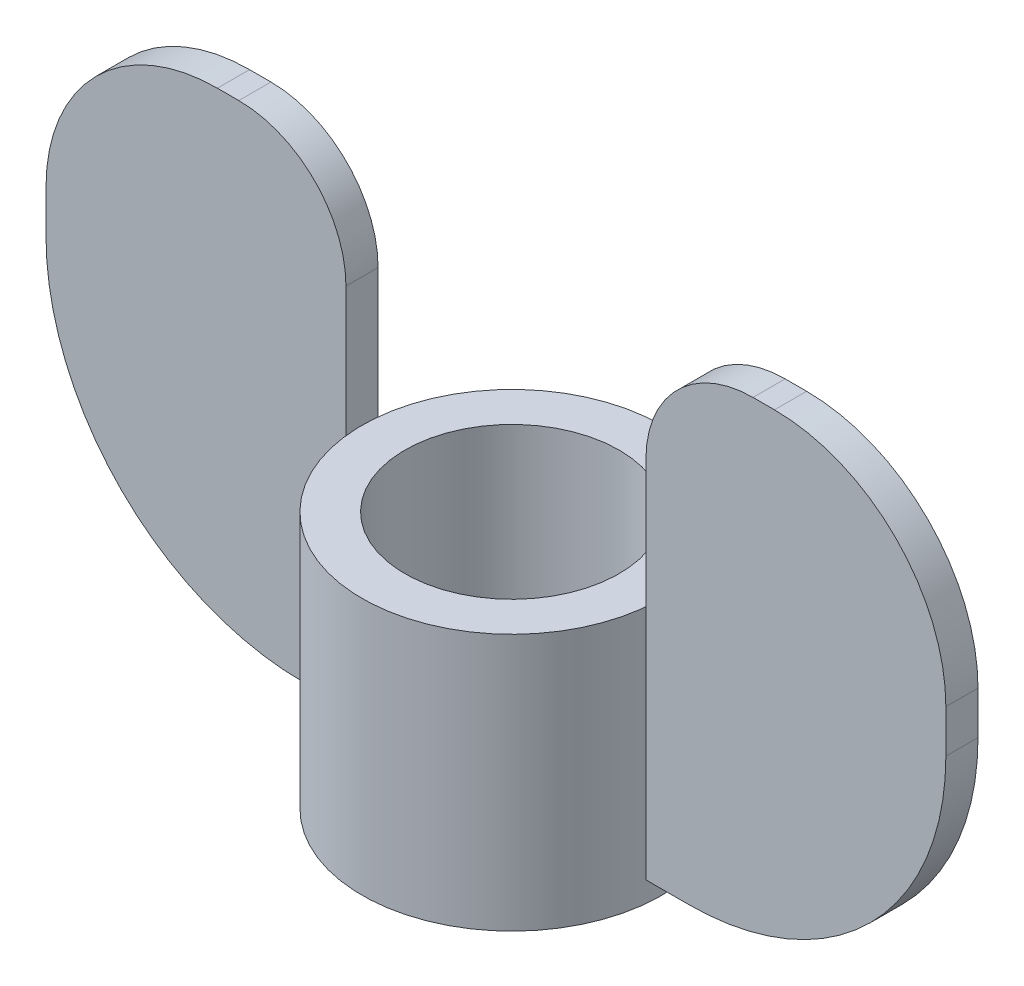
from build123d import *

# Parameters (mm, degrees)
ESTRUSIONE_ESTRUSIONE2_DEPTH      = 1.5
RACCORDO1_R                       = 5
RACCORDO2_R                       = 8
RACCORDO3_R                       = 12
ESTRUSIONE_ESTRUSIONE3_DEPTH      = 1
ESTRUSIONE_ESTRUSIONE3_DEPTH_BACK = 11
SCHIZZO2_R                        = 7
SCHIZZO2_R_2                      = 5
RIPETIZIONECIRCOLARE4_COUNT       = 2


with BuildPart() as part:
    # Schizzo1 → Estrusione-Estrusione2 (new body)
    with BuildSketch(Plane.XY):
        Polygon((-7, 10), (-7, -10), (7, -10), (7, 10), (7, 12), (-7, 12), align=None)
    extrude(amount=ESTRUSIONE_ESTRUSIONE2_DEPTH)

    # Raccordo1
    raccordo1_edges = [part.edges().sort_by_distance(p)[0] for p in [
        (7, 12, 0.75),
    ]]
    fillet(raccordo1_edges, radius=RACCORDO1_R)

    # Raccordo2
    raccordo2_edges = [part.edges().sort_by_distance(p)[0] for p in [
        (-7, 12, 0.75),
    ]]
    fillet(raccordo2_edges, radius=RACCORDO2_R)

    # Raccordo3
    raccordo3_edges = [part.edges().sort_by_distance(p)[0] for p in [
        (-7, -10, 0.75),
    ]]
    fillet(raccordo3_edges, radius=RACCORDO3_R)


with BuildPart() as body_2:
    # Schizzo2 → Estrusione-Estrusione3 (new, two sides: drawn at the far end of the back side and taken through both)
    with BuildSketch(Plane.XZ.offset(10).offset(-ESTRUSIONE_ESTRUSIONE3_DEPTH_BACK)):
        with Locations(Location((14, 0.75, 0), (0, 0, 270))):
            Circle(SCHIZZO2_R)
        with Locations(Location((14, 0.75, 0), (0, 0, 270))):
            Circle(SCHIZZO2_R_2, mode=Mode.SUBTRACT)
    extrude(amount=ESTRUSIONE_ESTRUSIONE3_DEPTH + ESTRUSIONE_ESTRUSIONE3_DEPTH_BACK)


with BuildPart() as ripetizionecircolare4_1:
    # RipetizioneCircolare4: pattern copy
    add(part.part.rotate(Axis((14, 0, 0.75), (0, 1, 0)), 1 * 360 / RIPETIZIONECIRCOLARE4_COUNT))


solid = Compound([part.part, body_2.part, ripetizionecircolare4_1.part])
